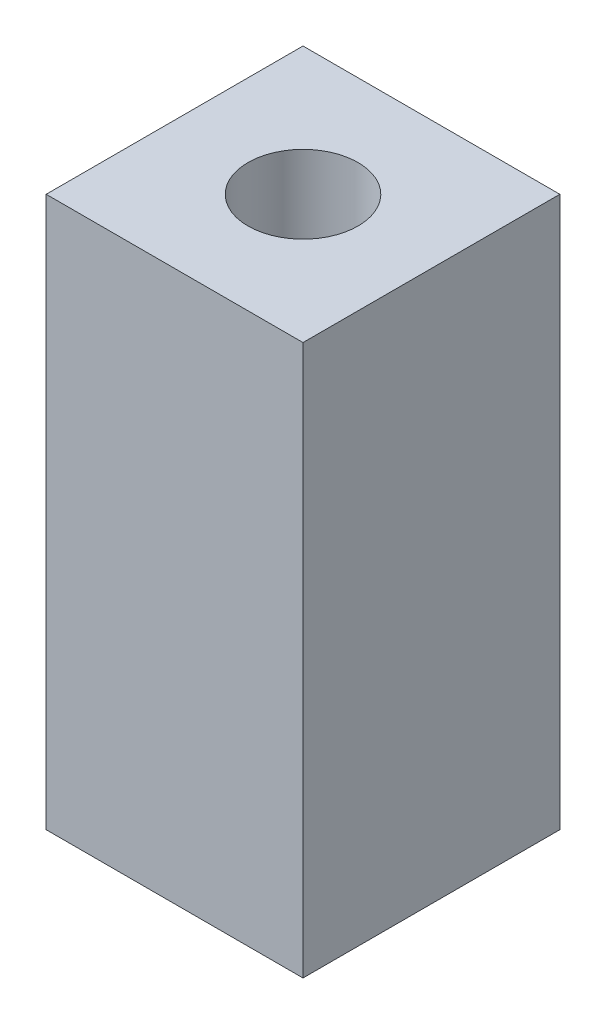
from build123d import *

# Parameters (mm, degrees)
SKETCH1_W           = 7
SKETCH1_H           = 7
SKETCH1_R           = 1.5
BOSS_EXTRUDE1_DEPTH = 15


with BuildPart() as part:
    # Sketch1 → Boss-Extrude1 (new body)
    with BuildSketch(Plane(origin=(0, 0, 0), x_dir=(1, 0, 0), z_dir=(0, 1, 0))):
        Rectangle(SKETCH1_W, SKETCH1_H)
        with Locations(Location((0, 0, 0), (0, 0, 270))):
            Circle(SKETCH1_R, mode=Mode.SUBTRACT)
    extrude(amount=BOSS_EXTRUDE1_DEPTH)


solid = part.part
